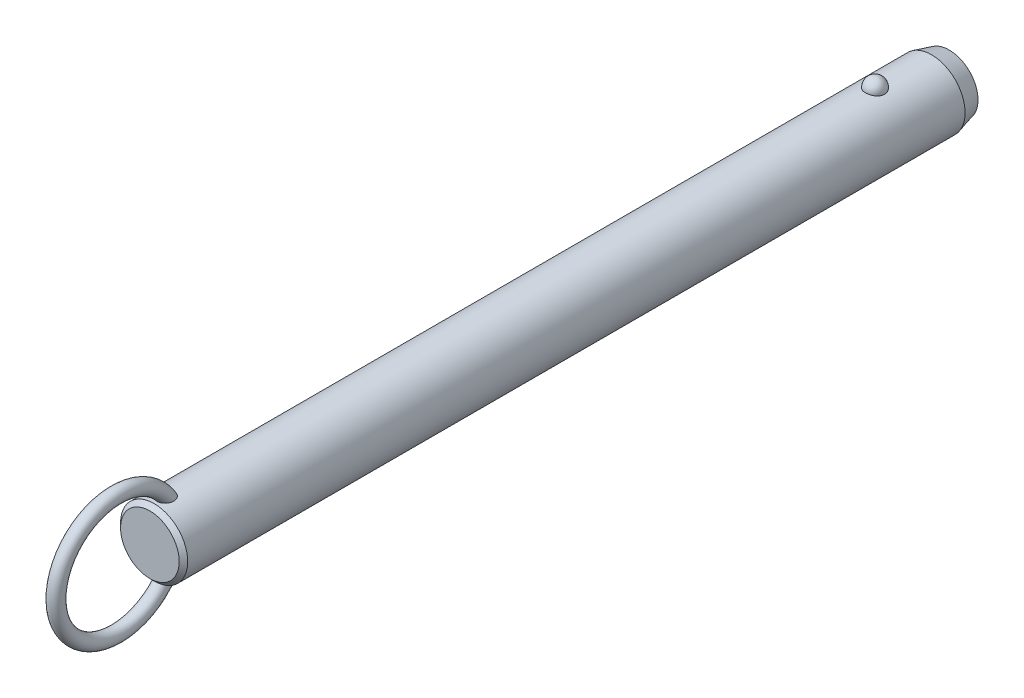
ISO-10303-21;
HEADER;
FILE_DESCRIPTION(('STEP AP214'),'2;1');
FILE_NAME('part.step','',(''),(''),'','','');
FILE_SCHEMA(('AUTOMOTIVE_DESIGN { 1 0 10303 214 1 1 1 1 }'));
ENDSEC;
DATA;
#1=APPLICATION_CONTEXT('core data for automotive mechanical design processes');
#2=APPLICATION_PROTOCOL_DEFINITION('international standard','automotive_design',2000,#1);
#3=PRODUCT_CONTEXT('',#1,'mechanical');
#4=PRODUCT('Part','Part','',(#3));
#5=PRODUCT_RELATED_PRODUCT_CATEGORY('part','',(#4));
#6=PRODUCT_DEFINITION_FORMATION('','',#4);
#7=PRODUCT_DEFINITION_CONTEXT('part definition',#1,'design');
#8=PRODUCT_DEFINITION('design','',#6,#7);
#9=PRODUCT_DEFINITION_SHAPE('','',#8);
#10=(LENGTH_UNIT() NAMED_UNIT(*) SI_UNIT(.MILLI.,.METRE.));
#11=(NAMED_UNIT(*) PLANE_ANGLE_UNIT() SI_UNIT($,.RADIAN.));
#12=(NAMED_UNIT(*) SI_UNIT($,.STERADIAN.) SOLID_ANGLE_UNIT());
#13=UNCERTAINTY_MEASURE_WITH_UNIT(LENGTH_MEASURE(1.E-05),#10,'distance_accuracy_value','');
#14=(GEOMETRIC_REPRESENTATION_CONTEXT(3) GLOBAL_UNCERTAINTY_ASSIGNED_CONTEXT((#13)) GLOBAL_UNIT_ASSIGNED_CONTEXT((#10,
#11,#12)) REPRESENTATION_CONTEXT('',''));
#15=CARTESIAN_POINT('',(0.,0.,0.));
#16=DIRECTION('',(0.,0.,1.));
#17=DIRECTION('',(1.,0.,0.));
#18=AXIS2_PLACEMENT_3D('',#15,#16,#17);
#19=CARTESIAN_POINT('',(0.,0.,193.));
#20=DIRECTION('',(0.,0.,-1.));
#21=DIRECTION('',(-1.,0.,0.));
#22=AXIS2_PLACEMENT_3D('',#19,#20,#21);
#23=CYLINDRICAL_SURFACE('',#22,9.5);
#24=CARTESIAN_POINT('',(2.67259918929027,9.11631578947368,-2.70000000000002));
#25=CARTESIAN_POINT('',(2.6725968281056,9.11631786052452,-2.54909854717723));
#26=CARTESIAN_POINT('',(2.66030567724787,9.11994722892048,-2.39816735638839));
#27=CARTESIAN_POINT('',(2.6114347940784,9.13405924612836,-2.10058568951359));
#28=CARTESIAN_POINT('',(2.57484658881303,9.14454428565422,-1.95393672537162));
#29=CARTESIAN_POINT('',(2.47830875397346,9.17117631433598,-1.66916069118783));
#30=CARTESIAN_POINT('',(2.41836936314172,9.18732082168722,-1.53102991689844));
#31=CARTESIAN_POINT('',(2.27661331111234,9.22346780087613,-1.26705393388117));
#32=CARTESIAN_POINT('',(2.19479699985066,9.24347021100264,-1.14120852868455));
#33=CARTESIAN_POINT('',(2.01085282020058,9.28522401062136,-0.904632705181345));
#34=CARTESIAN_POINT('',(1.90862396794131,9.30698376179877,-0.793982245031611));
#35=CARTESIAN_POINT('',(1.6867437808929,9.34973971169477,-0.59160721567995));
#36=CARTESIAN_POINT('',(1.56709244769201,9.37073591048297,-0.499882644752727));
#37=CARTESIAN_POINT('',(1.31393976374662,9.40956370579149,-0.338167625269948));
#38=CARTESIAN_POINT('',(1.18048026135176,9.42740444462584,-0.268113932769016));
#39=CARTESIAN_POINT('',(0.903154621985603,9.45799906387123,-0.151390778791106));
#40=CARTESIAN_POINT('',(0.759289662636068,9.47075351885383,-0.104718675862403));
#41=CARTESIAN_POINT('',(0.468074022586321,9.48956256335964,-0.0367633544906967));
#42=CARTESIAN_POINT('',(0.320836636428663,9.49573643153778,-0.0150275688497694));
#43=CARTESIAN_POINT('',(0.0246714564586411,9.50112183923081,0.00396199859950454));
#44=CARTESIAN_POINT('',(-0.124256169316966,9.50033406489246,0.00121819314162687));
#45=CARTESIAN_POINT('',(-0.417264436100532,9.4919475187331,-0.0284441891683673));
#46=CARTESIAN_POINT('',(-0.56138413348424,9.48444885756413,-0.0550074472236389));
#47=CARTESIAN_POINT('',(-0.842986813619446,9.46357853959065,-0.131064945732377));
#48=CARTESIAN_POINT('',(-0.980469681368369,9.450206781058,-0.180559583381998));
#49=CARTESIAN_POINT('',(-1.24585005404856,9.41890822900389,-0.301476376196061));
#50=CARTESIAN_POINT('',(-1.37368611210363,9.40095498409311,-0.373026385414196));
#51=CARTESIAN_POINT('',(-1.61552738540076,9.36242964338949,-0.536025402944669));
#52=CARTESIAN_POINT('',(-1.72953116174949,9.34185727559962,-0.627476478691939));
#53=CARTESIAN_POINT('',(-1.9429225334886,9.29984568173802,-0.829844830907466));
#54=CARTESIAN_POINT('',(-2.04198021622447,9.27839736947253,-0.941108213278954));
#55=CARTESIAN_POINT('',(-2.22026460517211,9.23735994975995,-1.17883414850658));
#56=CARTESIAN_POINT('',(-2.29948985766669,9.21777097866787,-1.30529781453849));
#57=CARTESIAN_POINT('',(-2.43697287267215,9.18238994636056,-1.57158566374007));
#58=CARTESIAN_POINT('',(-2.49497068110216,9.16664569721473,-1.71155057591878));
#59=CARTESIAN_POINT('',(-2.5872073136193,9.14104303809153,-1.99961197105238));
#60=CARTESIAN_POINT('',(-2.62144683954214,9.13118445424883,-2.1477082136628));
#61=CARTESIAN_POINT('',(-2.66521466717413,9.11850622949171,-2.44715424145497));
#62=CARTESIAN_POINT('',(-2.67484831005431,9.11565658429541,-2.59848735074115));
#63=CARTESIAN_POINT('',(-2.66946735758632,9.11723375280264,-2.90067317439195));
#64=CARTESIAN_POINT('',(-2.65445345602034,9.12166036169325,-3.05152590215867));
#65=CARTESIAN_POINT('',(-2.60029711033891,9.13724422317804,-3.34766110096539));
#66=CARTESIAN_POINT('',(-2.56127978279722,9.14836656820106,-3.49296833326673));
#67=CARTESIAN_POINT('',(-2.46018844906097,9.17606676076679,-3.77477535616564));
#68=CARTESIAN_POINT('',(-2.39811349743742,9.1926448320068,-3.91127478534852));
#69=CARTESIAN_POINT('',(-2.25202303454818,9.22952198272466,-4.17244273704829));
#70=CARTESIAN_POINT('',(-2.16788714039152,9.24984129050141,-4.29704106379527));
#71=CARTESIAN_POINT('',(-1.9799408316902,9.29188255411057,-4.53013066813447));
#72=CARTESIAN_POINT('',(-1.87612963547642,9.31360456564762,-4.63862130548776));
#73=CARTESIAN_POINT('',(-1.65105429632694,9.35612959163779,-4.83690299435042));
#74=CARTESIAN_POINT('',(-1.52972405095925,9.37692871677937,-4.9266199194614));
#75=CARTESIAN_POINT('',(-1.27318250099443,9.41518970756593,-5.08429106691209));
#76=CARTESIAN_POINT('',(-1.13797219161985,9.432651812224,-5.15224684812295));
#77=CARTESIAN_POINT('',(-0.859280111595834,9.46208255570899,-5.26371827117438));
#78=CARTESIAN_POINT('',(-0.715925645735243,9.47411833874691,-5.30753421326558));
#79=CARTESIAN_POINT('',(-0.423550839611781,9.4916822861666,-5.37076321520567));
#80=CARTESIAN_POINT('',(-0.2745312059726,9.49721125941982,-5.39017930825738));
#81=CARTESIAN_POINT('',(0.0218446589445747,9.50110860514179,-5.40390587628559));
#82=CARTESIAN_POINT('',(0.16917707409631,9.49961381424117,-5.39869609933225));
#83=CARTESIAN_POINT('',(0.460808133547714,9.48993906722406,-5.36441955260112));
#84=CARTESIAN_POINT('',(0.605106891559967,9.48175936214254,-5.33535367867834));
#85=CARTESIAN_POINT('',(0.886027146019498,9.4596376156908,-5.25435587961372));
#86=CARTESIAN_POINT('',(1.02267710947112,9.44571881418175,-5.20251612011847));
#87=CARTESIAN_POINT('',(1.28523827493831,9.41358993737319,-5.07741549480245));
#88=CARTESIAN_POINT('',(1.41114877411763,9.39537958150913,-5.00415322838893));
#89=CARTESIAN_POINT('',(1.65085227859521,9.3562644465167,-4.83684599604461));
#90=CARTESIAN_POINT('',(1.76442346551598,9.33532178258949,-4.74249218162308));
#91=CARTESIAN_POINT('',(1.97425672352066,9.29321198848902,-4.53620389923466));
#92=CARTESIAN_POINT('',(2.07051582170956,9.27204482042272,-4.42426641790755));
#93=CARTESIAN_POINT('',(2.24490086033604,9.23139221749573,-4.18363183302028));
#94=CARTESIAN_POINT('',(2.32267019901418,9.21194380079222,-4.05466990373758));
#95=CARTESIAN_POINT('',(2.45584092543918,9.1773419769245,-3.78517836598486));
#96=CARTESIAN_POINT('',(2.5112497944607,9.16218713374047,-3.644652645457));
#97=CARTESIAN_POINT('',(2.59380876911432,9.13913522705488,-3.37104301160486));
#98=CARTESIAN_POINT('',(2.62330266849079,9.13064624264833,-3.23871053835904));
#99=CARTESIAN_POINT('',(2.66269870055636,9.11923566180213,-2.97092664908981));
#100=CARTESIAN_POINT('',(2.67260130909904,9.11631393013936,-2.83547530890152));
#101=CARTESIAN_POINT('',(2.67259918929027,9.11631578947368,-2.70000000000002));
#102=B_SPLINE_CURVE_WITH_KNOTS('',3,(#24,#25,#26,#27,#28,#29,#30,#31,#32,#33,#34,#35,#36,#37,
#38,#39,#40,#41,#42,#43,#44,#45,#46,#47,#48,#49,#50,#51,#52,#53,#54,#55,#56,#57,#58,#59,#60,#61,
#62,#63,#64,#65,#66,#67,#68,#69,#70,#71,#72,#73,#74,#75,#76,#77,#78,#79,#80,#81,#82,#83,#84,#85,
#86,#87,#88,#89,#90,#91,#92,#93,#94,#95,#96,#97,#98,#99,#100,#101),.UNSPECIFIED.,.T.,.F.,(4,2,2,
2,2,2,2,2,2,2,2,2,2,2,2,2,2,2,2,2,2,2,2,2,2,2,2,2,2,2,2,2,2,2,2,2,2,2,4),(0.,0.452217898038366,
0.904593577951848,1.35677112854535,1.80894144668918,2.26340676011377,2.71787203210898,
3.17099820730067,3.62407318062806,4.0687883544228,4.51345969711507,4.95160616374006,
5.38976021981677,5.83050358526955,6.27129275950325,6.72071308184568,7.17016633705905,
7.62495278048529,8.07972578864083,8.53254856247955,8.98535859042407,9.43582813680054,
9.88631615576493,10.3393155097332,10.7923328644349,11.2471065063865,11.7018475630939,
12.150795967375,12.599688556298,13.0398725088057,13.4800399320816,13.9184421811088,
14.3568730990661,14.802202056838,15.2476074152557,15.7010097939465,16.1542603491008,
16.5602594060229,16.966248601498),.UNSPECIFIED.);
#103=CARTESIAN_POINT('',(2.67259918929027,9.11631578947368,-2.70000000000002));
#104=VERTEX_POINT('',#103);
#105=EDGE_CURVE('E41',#104,#104,#102,.T.);
#106=ORIENTED_EDGE('',*,*,#105,.T.);
#107=EDGE_LOOP('',(#106));
#108=FACE_BOUND('',#107,.T.);
#109=CARTESIAN_POINT('',(0.,0.,201.32));
#110=DIRECTION('',(0.,0.,1.));
#111=DIRECTION('',(1.,0.,0.));
#112=AXIS2_PLACEMENT_3D('',#109,#110,#111);
#113=CIRCLE('',#112,9.5);
#114=CARTESIAN_POINT('',(9.5,0.,201.32));
#115=VERTEX_POINT('',#114);
#116=EDGE_CURVE('E10',#115,#115,#113,.F.);
#117=ORIENTED_EDGE('',*,*,#116,.T.);
#118=EDGE_LOOP('',(#117));
#119=FACE_BOUND('',#118,.T.);
#120=CARTESIAN_POINT('',(-0.697062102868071,-9.47439269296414,195.667808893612));
#121=CARTESIAN_POINT('',(-0.799579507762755,-9.46685146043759,195.707482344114));
#122=CARTESIAN_POINT('',(-0.898575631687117,-9.45788043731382,195.7559309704));
#123=CARTESIAN_POINT('',(-1.08670047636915,-9.43811593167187,195.868868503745));
#124=CARTESIAN_POINT('',(-1.17583204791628,-9.42732297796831,195.933352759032));
#125=CARTESIAN_POINT('',(-1.34179806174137,-9.40513672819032,196.076209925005));
#126=CARTESIAN_POINT('',(-1.41865133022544,-9.39374438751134,196.154561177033));
#127=CARTESIAN_POINT('',(-1.55860047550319,-9.37154196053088,196.322752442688));
#128=CARTESIAN_POINT('',(-1.62169476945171,-9.3607319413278,196.41259377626));
#129=CARTESIAN_POINT('',(-1.73527695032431,-9.34035749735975,196.604500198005));
#130=CARTESIAN_POINT('',(-1.78522266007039,-9.33085270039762,196.706891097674));
#131=CARTESIAN_POINT('',(-1.86924997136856,-9.3143834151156,196.918148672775));
#132=CARTESIAN_POINT('',(-1.90332570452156,-9.30741986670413,197.027017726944));
#133=CARTESIAN_POINT('',(-1.95893603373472,-9.29588482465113,197.260473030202));
#134=CARTESIAN_POINT('',(-1.97872420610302,-9.29165182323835,197.385489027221));
#135=CARTESIAN_POINT('',(-2.00062129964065,-9.28695978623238,197.637080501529));
#136=CARTESIAN_POINT('',(-2.00272284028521,-9.28650232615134,197.763656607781));
#137=CARTESIAN_POINT('',(-1.98958876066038,-9.28932750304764,198.036815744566));
#138=CARTESIAN_POINT('',(-1.97143366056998,-9.2932400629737,198.183251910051));
#139=CARTESIAN_POINT('',(-1.91479925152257,-9.30507151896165,198.472062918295));
#140=CARTESIAN_POINT('',(-1.87629122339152,-9.31299607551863,198.614431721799));
#141=CARTESIAN_POINT('',(-1.77225683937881,-9.33340232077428,198.915172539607));
#142=CARTESIAN_POINT('',(-1.70334898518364,-9.34641636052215,199.072369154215));
#143=CARTESIAN_POINT('',(-1.58111062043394,-9.36759153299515,199.297517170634));
#144=CARTESIAN_POINT('',(-1.53721459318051,-9.37492619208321,199.370796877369));
#145=CARTESIAN_POINT('',(-1.4430263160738,-9.38988566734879,199.51307405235));
#146=CARTESIAN_POINT('',(-1.39273721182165,-9.39751033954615,199.582073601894));
#147=CARTESIAN_POINT('',(-1.26775962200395,-9.41530678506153,199.736983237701));
#148=CARTESIAN_POINT('',(-1.19052326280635,-9.42548108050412,199.820871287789));
#149=CARTESIAN_POINT('',(-1.02420241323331,-9.44499825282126,199.976008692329));
#150=CARTESIAN_POINT('',(-0.93513986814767,-9.45434261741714,200.047280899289));
#151=CARTESIAN_POINT('',(-0.766610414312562,-9.46930670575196,200.158695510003));
#152=CARTESIAN_POINT('',(-0.689439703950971,-9.47529223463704,200.202235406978));
#153=CARTESIAN_POINT('',(-0.528942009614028,-9.48560294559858,200.27631336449));
#154=CARTESIAN_POINT('',(-0.445620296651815,-9.48992953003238,200.306862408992));
#155=CARTESIAN_POINT('',(-0.273901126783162,-9.49644161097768,200.352579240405));
#156=CARTESIAN_POINT('',(-0.18546574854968,-9.49860811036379,200.36761059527));
#157=CARTESIAN_POINT('',(-0.00734541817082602,-9.5004135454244,200.380149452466));
#158=CARTESIAN_POINT('',(0.0823387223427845,-9.50005405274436,200.377667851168));
#159=CARTESIAN_POINT('',(0.24767927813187,-9.49708301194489,200.356995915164));
#160=CARTESIAN_POINT('',(0.323620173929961,-9.49477609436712,200.340930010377));
#161=CARTESIAN_POINT('',(0.471981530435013,-9.48855917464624,200.297172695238));
#162=CARTESIAN_POINT('',(0.544400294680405,-9.48464840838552,200.269475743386));
#163=CARTESIAN_POINT('',(0.708947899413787,-9.47398336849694,200.19280266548));
#164=CARTESIAN_POINT('',(0.799149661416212,-9.46671310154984,200.139774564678));
#165=CARTESIAN_POINT('',(0.969783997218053,-9.45076225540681,200.019973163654));
#166=CARTESIAN_POINT('',(1.050194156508,-9.44207854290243,199.953169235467));
#167=CARTESIAN_POINT('',(1.23092343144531,-9.42051459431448,199.780759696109));
#168=CARTESIAN_POINT('',(1.32652499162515,-9.40733378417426,199.67026193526));
#169=CARTESIAN_POINT('',(1.49893121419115,-9.38140745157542,199.435561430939));
#170=CARTESIAN_POINT('',(1.5757161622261,-9.36866239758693,199.311344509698));
#171=CARTESIAN_POINT('',(1.71285426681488,-9.34457644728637,199.049389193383));
#172=CARTESIAN_POINT('',(1.77266365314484,-9.33328726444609,198.91136233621));
#173=CARTESIAN_POINT('',(1.87239208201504,-9.31379209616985,198.628051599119));
#174=CARTESIAN_POINT('',(1.91230158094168,-9.3055875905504,198.482764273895));
#175=CARTESIAN_POINT('',(1.97604189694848,-9.29228394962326,198.162028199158));
#176=CARTESIAN_POINT('',(1.9958743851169,-9.28797202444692,197.985724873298));
#177=CARTESIAN_POINT('',(2.0029570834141,-9.28645519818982,197.632414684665));
#178=CARTESIAN_POINT('',(1.99025930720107,-9.28923895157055,197.455409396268));
#179=CARTESIAN_POINT('',(1.93735479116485,-9.30038134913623,197.156338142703));
#180=CARTESIAN_POINT('',(1.90576827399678,-9.30697680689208,197.032667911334));
#181=CARTESIAN_POINT('',(1.8228748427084,-9.32356855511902,196.792329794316));
#182=CARTESIAN_POINT('',(1.77158213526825,-9.33356239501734,196.675656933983));
#183=CARTESIAN_POINT('',(1.64885744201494,-9.35602275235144,196.452706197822));
#184=CARTESIAN_POINT('',(1.57730995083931,-9.36850332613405,196.346492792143));
#185=CARTESIAN_POINT('',(1.41543264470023,-9.39431873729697,196.149553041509));
#186=CARTESIAN_POINT('',(1.32510883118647,-9.40765330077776,196.058821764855));
#187=CARTESIAN_POINT('',(1.13846223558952,-9.43195720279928,195.905033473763));
#188=CARTESIAN_POINT('',(1.04369890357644,-9.44302894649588,195.840094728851));
#189=CARTESIAN_POINT('',(0.843965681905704,-9.46296805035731,195.728038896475));
#190=CARTESIAN_POINT('',(0.739000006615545,-9.47183631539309,195.680914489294));
#191=CARTESIAN_POINT('',(0.528175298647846,-9.48586140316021,195.608117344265));
#192=CARTESIAN_POINT('',(0.422686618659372,-9.49119633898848,195.58140249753));
#193=CARTESIAN_POINT('',(0.208590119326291,-9.49831365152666,195.546013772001));
#194=CARTESIAN_POINT('',(0.0999817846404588,-9.500095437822,195.537342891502));
#195=CARTESIAN_POINT('',(-0.126104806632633,-9.49988861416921,195.538350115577));
#196=CARTESIAN_POINT('',(-0.243578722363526,-9.49757821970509,195.549594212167));
#197=CARTESIAN_POINT('',(-0.474390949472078,-9.48885165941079,195.593167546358));
#198=CARTESIAN_POINT('',(-0.587729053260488,-9.48243528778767,195.625497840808));
#199=CARTESIAN_POINT('',(-0.697062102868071,-9.47439269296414,195.667808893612));
#200=B_SPLINE_CURVE_WITH_KNOTS('',3,(#120,#121,#122,#123,#124,#125,#126,#127,#128,#129,#130,
#131,#132,#133,#134,#135,#136,#137,#138,#139,#140,#141,#142,#143,#144,#145,#146,#147,#148,#149,
#150,#151,#152,#153,#154,#155,#156,#157,#158,#159,#160,#161,#162,#163,#164,#165,#166,#167,#168,
#169,#170,#171,#172,#173,#174,#175,#176,#177,#178,#179,#180,#181,#182,#183,#184,#185,#186,#187,
#188,#189,#190,#191,#192,#193,#194,#195,#196,#197,#198,#199),.UNSPECIFIED.,.T.,.F.,(4,2,2,2,2,2,
2,2,2,2,2,2,2,2,2,2,2,2,2,2,2,2,2,2,2,2,2,2,2,2,2,2,2,2,2,2,2,2,2,4),(0.,0.330119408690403,
0.660143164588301,0.989655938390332,1.31920659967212,1.66074728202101,2.00241415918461,
2.38088696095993,2.75951768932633,3.20065679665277,3.64242004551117,4.15620996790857,
4.4131416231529,4.66994734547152,5.01228664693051,5.35399933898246,5.61943037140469,
5.88463652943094,6.15215502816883,6.4195070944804,6.65144391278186,6.88349136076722,
7.19641200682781,7.51003602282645,7.94779711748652,8.3860149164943,8.83699707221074,
9.28819530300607,9.81778662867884,10.34653170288,10.7284172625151,11.1100280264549,
11.4938603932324,11.8775702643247,12.2220189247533,12.5663259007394,12.8915939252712,
13.2169159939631,13.5689650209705,13.9210316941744),.UNSPECIFIED.);
#201=CARTESIAN_POINT('',(-0.697062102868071,-9.47439269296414,195.667808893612));
#202=VERTEX_POINT('',#201);
#203=EDGE_CURVE('E59',#202,#202,#200,.T.);
#204=ORIENTED_EDGE('',*,*,#203,.T.);
#205=EDGE_LOOP('',(#204));
#206=FACE_BOUND('',#205,.T.);
#207=CARTESIAN_POINT('',(-0.697062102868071,9.47439269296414,195.667808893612));
#208=CARTESIAN_POINT('',(-0.597792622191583,9.48169483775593,195.62939564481));
#209=CARTESIAN_POINT('',(-0.495106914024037,9.48766580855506,195.599168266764));
#210=CARTESIAN_POINT('',(-0.285876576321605,9.49627648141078,195.556032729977));
#211=CARTESIAN_POINT('',(-0.179324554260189,9.49890941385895,195.543159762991));
#212=CARTESIAN_POINT('',(0.0344157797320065,9.50053798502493,195.535166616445));
#213=CARTESIAN_POINT('',(0.141603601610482,9.49953613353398,195.540034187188));
#214=CARTESIAN_POINT('',(0.35356357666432,9.49401038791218,195.567365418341));
#215=CARTESIAN_POINT('',(0.458336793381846,9.48948807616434,195.58982117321));
#216=CARTESIAN_POINT('',(0.662493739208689,9.4774236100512,195.651671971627));
#217=CARTESIAN_POINT('',(0.761881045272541,9.46988348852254,195.691055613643));
#218=CARTESIAN_POINT('',(0.95260839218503,9.45260382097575,195.785634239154));
#219=CARTESIAN_POINT('',(1.04394806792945,9.44286417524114,195.840829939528));
#220=CARTESIAN_POINT('',(1.21712767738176,9.42211760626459,195.966066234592));
#221=CARTESIAN_POINT('',(1.29885671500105,9.41109835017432,196.036257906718));
#222=CARTESIAN_POINT('',(1.44978975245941,9.38903310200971,196.188980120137));
#223=CARTESIAN_POINT('',(1.51899278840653,9.37798710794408,196.271511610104));
#224=CARTESIAN_POINT('',(1.64602857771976,9.35654375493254,196.449776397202));
#225=CARTESIAN_POINT('',(1.70333052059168,9.34618688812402,196.545891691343));
#226=CARTESIAN_POINT('',(1.80259341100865,9.32755128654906,196.745897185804));
#227=CARTESIAN_POINT('',(1.84454942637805,9.31927322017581,196.849789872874));
#228=CARTESIAN_POINT('',(1.91637039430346,9.30478365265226,197.072213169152));
#229=CARTESIAN_POINT('',(1.944805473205,9.29882552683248,197.191219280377));
#230=CARTESIAN_POINT('',(1.98449865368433,9.29043398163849,197.432143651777));
#231=CARTESIAN_POINT('',(1.99574908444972,9.28800213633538,197.554063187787));
#232=CARTESIAN_POINT('',(2.00275141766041,9.28649645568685,197.816932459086));
#233=CARTESIAN_POINT('',(1.99588238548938,9.28799035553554,197.957952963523));
#234=CARTESIAN_POINT('',(1.96270559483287,9.29505517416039,198.237621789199));
#235=CARTESIAN_POINT('',(1.93637872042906,9.30063010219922,198.376267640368));
#236=CARTESIAN_POINT('',(1.85949176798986,9.31633564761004,198.672561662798));
#237=CARTESIAN_POINT('',(1.80549792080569,9.3270926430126,198.829290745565));
#238=CARTESIAN_POINT('',(1.67376869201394,9.3516306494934,199.132284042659));
#239=CARTESIAN_POINT('',(1.59603181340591,9.36541185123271,199.278547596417));
#240=CARTESIAN_POINT('',(1.4360277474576,9.39110706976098,199.525813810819));
#241=CARTESIAN_POINT('',(1.35831795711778,9.40278656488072,199.629791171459));
#242=CARTESIAN_POINT('',(1.18774483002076,9.42585025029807,199.824534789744));
#243=CARTESIAN_POINT('',(1.09490932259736,9.43723493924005,199.915324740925));
#244=CARTESIAN_POINT('',(0.921110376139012,9.45552616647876,200.05620334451));
#245=CARTESIAN_POINT('',(0.843738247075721,9.46281058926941,200.110656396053));
#246=CARTESIAN_POINT('',(0.681245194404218,9.47589120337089,200.206711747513));
#247=CARTESIAN_POINT('',(0.596135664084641,9.48168953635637,200.248332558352));
#248=CARTESIAN_POINT('',(0.433779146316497,9.49038144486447,200.310089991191));
#249=CARTESIAN_POINT('',(0.357459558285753,9.49359170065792,200.33260136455));
#250=CARTESIAN_POINT('',(0.202074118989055,9.49816761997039,200.364574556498));
#251=CARTESIAN_POINT('',(0.123010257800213,9.49953459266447,200.374045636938));
#252=CARTESIAN_POINT('',(-0.0357372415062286,9.50026497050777,200.379114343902));
#253=CARTESIAN_POINT('',(-0.115421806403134,9.49962433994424,200.374684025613));
#254=CARTESIAN_POINT('',(-0.272823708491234,9.49640854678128,200.352296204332));
#255=CARTESIAN_POINT('',(-0.350540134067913,9.4938325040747,200.334332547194));
#256=CARTESIAN_POINT('',(-0.500580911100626,9.48709462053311,200.286802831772));
#257=CARTESIAN_POINT('',(-0.572979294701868,9.48296359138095,200.257461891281));
#258=CARTESIAN_POINT('',(-0.712864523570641,9.47347609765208,200.189008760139));
#259=CARTESIAN_POINT('',(-0.780349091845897,9.46811906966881,200.149892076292));
#260=CARTESIAN_POINT('',(-0.946309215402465,9.45329720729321,200.039432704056));
#261=CARTESIAN_POINT('',(-1.04090230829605,9.44321512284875,199.962329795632));
#262=CARTESIAN_POINT('',(-1.21661929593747,9.42219227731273,199.79409718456));
#263=CARTESIAN_POINT('',(-1.29770519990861,9.41124921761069,199.702929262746));
#264=CARTESIAN_POINT('',(-1.47319646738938,9.38563439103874,199.476162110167));
#265=CARTESIAN_POINT('',(-1.56208878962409,9.37102009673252,199.336289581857));
#266=CARTESIAN_POINT('',(-1.71623987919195,9.34401559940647,199.043950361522));
#267=CARTESIAN_POINT('',(-1.78147866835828,9.33162728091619,198.891473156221));
#268=CARTESIAN_POINT('',(-1.88853837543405,9.31055541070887,198.575647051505));
#269=CARTESIAN_POINT('',(-1.92998995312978,9.30193076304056,198.412168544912));
#270=CARTESIAN_POINT('',(-1.98590726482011,9.29015757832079,198.080526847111));
#271=CARTESIAN_POINT('',(-2.0004070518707,9.2870021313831,197.912369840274));
#272=CARTESIAN_POINT('',(-1.99964701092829,9.28716218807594,197.605080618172));
#273=CARTESIAN_POINT('',(-1.98908145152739,9.28945704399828,197.465936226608));
#274=CARTESIAN_POINT('',(-1.94566294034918,9.29865169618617,197.191153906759));
#275=CARTESIAN_POINT('',(-1.9128206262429,9.30554929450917,197.055514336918));
#276=CARTESIAN_POINT('',(-1.84582133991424,9.31898248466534,196.857802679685));
#277=CARTESIAN_POINT('',(-1.82038084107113,9.32400364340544,196.792583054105));
#278=CARTESIAN_POINT('',(-1.76350511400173,9.33492884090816,196.664903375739));
#279=CARTESIAN_POINT('',(-1.73207305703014,9.34083241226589,196.602441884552));
#280=CARTESIAN_POINT('',(-1.66324243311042,9.35333332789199,196.48094078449));
#281=CARTESIAN_POINT('',(-1.62584239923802,9.35993084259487,196.421902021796));
#282=CARTESIAN_POINT('',(-1.54527678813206,9.37356864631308,196.307987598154));
#283=CARTESIAN_POINT('',(-1.50211241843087,9.38060884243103,196.253111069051));
#284=CARTESIAN_POINT('',(-1.37681147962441,9.40004442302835,196.109961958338));
#285=CARTESIAN_POINT('',(-1.28916358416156,9.41261047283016,196.026429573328));
#286=CARTESIAN_POINT('',(-1.09996826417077,9.43658180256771,195.877236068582));
#287=CARTESIAN_POINT('',(-0.998461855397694,9.44799034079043,195.811523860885));
#288=CARTESIAN_POINT('',(-0.860188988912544,9.46103017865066,195.7394367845));
#289=CARTESIAN_POINT('',(-0.828141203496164,9.46389141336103,195.723851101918));
#290=CARTESIAN_POINT('',(-0.763210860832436,9.46934915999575,195.694473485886));
#291=CARTESIAN_POINT('',(-0.730328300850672,9.47194567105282,195.680681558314));
#292=CARTESIAN_POINT('',(-0.697062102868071,9.47439269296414,195.667808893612));
#293=B_SPLINE_CURVE_WITH_KNOTS('',3,(#207,#208,#209,#210,#211,#212,#213,#214,#215,#216,#217,
#218,#219,#220,#221,#222,#223,#224,#225,#226,#227,#228,#229,#230,#231,#232,#233,#234,#235,#236,
#237,#238,#239,#240,#241,#242,#243,#244,#245,#246,#247,#248,#249,#250,#251,#252,#253,#254,#255,
#256,#257,#258,#259,#260,#261,#262,#263,#264,#265,#266,#267,#268,#269,#270,#271,#272,#273,#274,
#275,#276,#277,#278,#279,#280,#281,#282,#283,#284,#285,#286,#287,#288,#289,#290,#291,#292),
.UNSPECIFIED.,.T.,.F.,(4,2,2,2,2,2,2,2,2,2,2,2,2,2,2,2,2,2,2,2,2,2,2,2,2,2,2,2,2,2,2,2,2,2,2,2,
2,2,2,2,2,2,4),(0.,0.319942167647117,0.640532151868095,0.96090081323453,1.2811255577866,
1.60113495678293,1.92115886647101,2.24457323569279,2.56801248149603,2.90371927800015,
3.23953387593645,3.60560313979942,3.97183576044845,4.39383693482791,4.8162532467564,
5.31257045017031,5.80891895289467,6.19868344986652,6.58773876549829,6.87145417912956,
7.15475838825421,7.39263751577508,7.63034760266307,7.86853584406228,8.10683246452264,
8.3406366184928,8.57454843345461,8.93983939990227,9.30614105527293,9.80266668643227,
10.2996107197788,10.8040753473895,11.3079021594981,11.7249776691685,12.1418541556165,
12.3521485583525,12.5623319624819,12.7725671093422,12.9827582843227,13.345827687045,
13.7078449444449,13.8150604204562,13.9222762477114),.UNSPECIFIED.);
#294=CARTESIAN_POINT('',(-0.697062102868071,9.47439269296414,195.667808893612));
#295=VERTEX_POINT('',#294);
#296=EDGE_CURVE('E67',#295,#295,#293,.T.);
#297=ORIENTED_EDGE('',*,*,#296,.T.);
#298=EDGE_LOOP('',(#297));
#299=FACE_BOUND('',#298,.T.);
#300=CARTESIAN_POINT('',(0.,0.,-18.7));
#301=DIRECTION('',(0.,0.,-1.));
#302=DIRECTION('',(-1.,0.,0.));
#303=AXIS2_PLACEMENT_3D('',#300,#301,#302);
#304=CIRCLE('',#303,9.5);
#305=CARTESIAN_POINT('',(-9.5,0.,-18.7));
#306=VERTEX_POINT('',#305);
#307=EDGE_CURVE('E56',#306,#306,#304,.F.);
#308=ORIENTED_EDGE('',*,*,#307,.T.);
#309=EDGE_LOOP('',(#308));
#310=FACE_BOUND('',#309,.T.);
#311=ADVANCED_FACE('F37',(#108,#119,#206,#299,#310),#23,.T.);
#312=CARTESIAN_POINT('',(0.,0.,-23.7));
#313=DIRECTION('',(0.,0.,-1.));
#314=DIRECTION('',(-1.,0.,0.));
#315=AXIS2_PLACEMENT_3D('',#312,#313,#314);
#316=PLANE('',#315);
#317=CARTESIAN_POINT('',(0.,0.,-23.7));
#318=DIRECTION('',(0.,0.,-1.));
#319=DIRECTION('',(-1.,0.,0.));
#320=AXIS2_PLACEMENT_3D('',#317,#318,#319);
#321=CIRCLE('',#320,8.16025403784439);
#322=CARTESIAN_POINT('',(-8.16025403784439,0.,-23.7));
#323=VERTEX_POINT('',#322);
#324=EDGE_CURVE('E66',#323,#323,#321,.T.);
#325=ORIENTED_EDGE('',*,*,#324,.T.);
#326=EDGE_LOOP('',(#325));
#327=FACE_BOUND('',#326,.T.);
#328=ADVANCED_FACE('F85',(#327),#316,.T.);
#329=CARTESIAN_POINT('',(0.,0.,-23.7));
#330=DIRECTION('',(0.,0.,1.));
#331=DIRECTION('',(1.,0.,0.));
#332=AXIS2_PLACEMENT_3D('',#329,#330,#331);
#333=CONICAL_SURFACE('',#332,8.16025403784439,0.261799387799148);
#334=ORIENTED_EDGE('',*,*,#307,.F.);
#335=EDGE_LOOP('',(#334));
#336=FACE_BOUND('',#335,.T.);
#337=ORIENTED_EDGE('',*,*,#324,.F.);
#338=EDGE_LOOP('',(#337));
#339=FACE_BOUND('',#338,.T.);
#340=ADVANCED_FACE('F83',(#336,#339),#333,.T.);
#341=CARTESIAN_POINT('',(0.,0.,202.52));
#342=DIRECTION('',(0.,0.,1.));
#343=DIRECTION('',(1.,0.,0.));
#344=AXIS2_PLACEMENT_3D('',#341,#342,#343);
#345=PLANE('',#344);
#346=CARTESIAN_POINT('',(0.,0.,202.52));
#347=DIRECTION('',(0.,0.,1.));
#348=DIRECTION('',(1.,0.,0.));
#349=AXIS2_PLACEMENT_3D('',#346,#347,#348);
#350=CIRCLE('',#349,8.3);
#351=CARTESIAN_POINT('',(8.3,0.,202.52));
#352=VERTEX_POINT('',#351);
#353=EDGE_CURVE('E50',#352,#352,#350,.T.);
#354=ORIENTED_EDGE('',*,*,#353,.T.);
#355=EDGE_LOOP('',(#354));
#356=FACE_BOUND('',#355,.T.);
#357=ADVANCED_FACE('F77',(#356),#345,.T.);
#358=CARTESIAN_POINT('',(0.,0.,212.05));
#359=DIRECTION('',(1.,0.,0.));
#360=DIRECTION('',(0.,0.,-1.));
#361=AXIS2_PLACEMENT_3D('',#358,#359,#360);
#362=TOROIDAL_SURFACE('',#361,17.05,2.);
#363=ORIENTED_EDGE('',*,*,#296,.F.);
#364=EDGE_LOOP('',(#363));
#365=FACE_BOUND('',#364,.T.);
#366=ORIENTED_EDGE('',*,*,#203,.F.);
#367=EDGE_LOOP('',(#366));
#368=FACE_BOUND('',#367,.T.);
#369=ADVANCED_FACE('F73',(#365,#368),#362,.T.);
#370=CARTESIAN_POINT('',(0.,0.,202.52));
#371=DIRECTION('',(0.,0.,-1.));
#372=DIRECTION('',(-1.,0.,0.));
#373=AXIS2_PLACEMENT_3D('',#370,#371,#372);
#374=CONICAL_SURFACE('',#373,8.3,0.785398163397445);
#375=ORIENTED_EDGE('',*,*,#116,.F.);
#376=EDGE_LOOP('',(#375));
#377=FACE_BOUND('',#376,.T.);
#378=ORIENTED_EDGE('',*,*,#353,.F.);
#379=EDGE_LOOP('',(#378));
#380=FACE_BOUND('',#379,.T.);
#381=ADVANCED_FACE('F39',(#377,#380),#374,.T.);
#382=CARTESIAN_POINT('',(0.,9.5,-2.70000000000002));
#383=DIRECTION('',(0.,1.,0.));
#384=DIRECTION('',(0.,0.,-1.));
#385=AXIS2_PLACEMENT_3D('',#382,#383,#384);
#386=SPHERICAL_SURFACE('',#385,2.7);
#387=ORIENTED_EDGE('',*,*,#105,.F.);
#388=EDGE_LOOP('',(#387));
#389=FACE_BOUND('',#388,.T.);
#390=ADVANCED_FACE('F79',(#389),#386,.T.);
#391=CLOSED_SHELL('',(#311,#328,#340,#357,#369,#381,#390));
#392=MANIFOLD_SOLID_BREP('B2',#391);
#393=ADVANCED_BREP_SHAPE_REPRESENTATION('',(#18,#392),#14);
#394=SHAPE_DEFINITION_REPRESENTATION(#9,#393);
ENDSEC;
END-ISO-10303-21;
